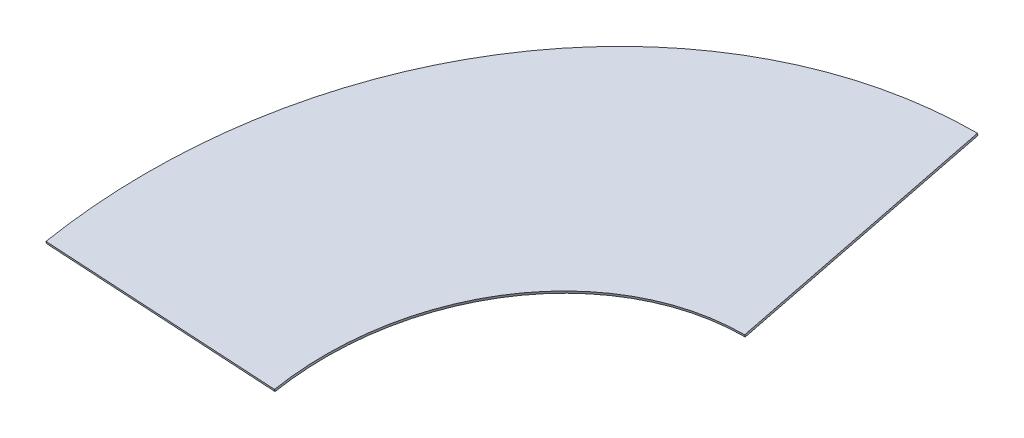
ISO-10303-21;
HEADER;
FILE_DESCRIPTION(('STEP AP214'),'2;1');
FILE_NAME('part.step','',(''),(''),'','','');
FILE_SCHEMA(('AUTOMOTIVE_DESIGN { 1 0 10303 214 1 1 1 1 }'));
ENDSEC;
DATA;
#1=APPLICATION_CONTEXT('core data for automotive mechanical design processes');
#2=APPLICATION_PROTOCOL_DEFINITION('international standard','automotive_design',2000,#1);
#3=PRODUCT_CONTEXT('',#1,'mechanical');
#4=PRODUCT('Part','Part','',(#3));
#5=PRODUCT_RELATED_PRODUCT_CATEGORY('part','',(#4));
#6=PRODUCT_DEFINITION_FORMATION('','',#4);
#7=PRODUCT_DEFINITION_CONTEXT('part definition',#1,'design');
#8=PRODUCT_DEFINITION('design','',#6,#7);
#9=PRODUCT_DEFINITION_SHAPE('','',#8);
#10=(LENGTH_UNIT() NAMED_UNIT(*) SI_UNIT(.MILLI.,.METRE.));
#11=(NAMED_UNIT(*) PLANE_ANGLE_UNIT() SI_UNIT($,.RADIAN.));
#12=(NAMED_UNIT(*) SI_UNIT($,.STERADIAN.) SOLID_ANGLE_UNIT());
#13=UNCERTAINTY_MEASURE_WITH_UNIT(LENGTH_MEASURE(1.E-05),#10,'distance_accuracy_value','');
#14=(GEOMETRIC_REPRESENTATION_CONTEXT(3) GLOBAL_UNCERTAINTY_ASSIGNED_CONTEXT((#13)) GLOBAL_UNIT_ASSIGNED_CONTEXT((#10,
#11,#12)) REPRESENTATION_CONTEXT('',''));
#15=CARTESIAN_POINT('',(0.,0.,0.));
#16=DIRECTION('',(0.,0.,1.));
#17=DIRECTION('',(1.,0.,0.));
#18=AXIS2_PLACEMENT_3D('',#15,#16,#17);
#19=CARTESIAN_POINT('',(0.,50.,0.));
#20=DIRECTION('',(1.,0.,0.));
#21=DIRECTION('',(0.,-0.242535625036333,0.970142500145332));
#22=AXIS2_PLACEMENT_3D('',#19,#20,#21);
#23=PLANE('',#22);
#24=DIRECTION('',(0.,-0.970142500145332,-0.242535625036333));
#25=VECTOR('',#24,1.);
#26=CARTESIAN_POINT('',(0.,50.,0.));
#27=LINE('',#26,#25);
#28=CARTESIAN_POINT('',(0.,50.9701425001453,0.242535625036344));
#29=VERTEX_POINT('',#28);
#30=CARTESIAN_POINT('',(0.,50.,0.));
#31=VERTEX_POINT('',#30);
#32=EDGE_CURVE('E12',#29,#31,#27,.T.);
#33=ORIENTED_EDGE('',*,*,#32,.F.);
#34=DIRECTION('',(0.,0.242535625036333,-0.970142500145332));
#35=VECTOR('',#34,1.);
#36=CARTESIAN_POINT('',(0.,0.970142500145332,200.242535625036));
#37=LINE('',#36,#35);
#38=CARTESIAN_POINT('',(0.,25.9701425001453,100.242535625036));
#39=VERTEX_POINT('',#38);
#40=EDGE_CURVE('E88',#29,#39,#37,.F.);
#41=ORIENTED_EDGE('',*,*,#40,.T.);
#42=DIRECTION('',(0.,-0.970142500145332,-0.242535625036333));
#43=VECTOR('',#42,1.);
#44=CARTESIAN_POINT('',(0.,25.,100.));
#45=LINE('',#44,#43);
#46=CARTESIAN_POINT('',(0.,25.,100.));
#47=VERTEX_POINT('',#46);
#48=EDGE_CURVE('E62',#39,#47,#45,.T.);
#49=ORIENTED_EDGE('',*,*,#48,.T.);
#50=DIRECTION('',(0.,-0.242535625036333,0.970142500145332));
#51=VECTOR('',#50,1.);
#52=CARTESIAN_POINT('',(0.,50.,0.));
#53=LINE('',#52,#51);
#54=EDGE_CURVE('E91',#31,#47,#53,.T.);
#55=ORIENTED_EDGE('',*,*,#54,.F.);
#56=EDGE_LOOP('',(#33,#41,#49,#55));
#57=FACE_BOUND('',#56,.T.);
#58=ADVANCED_FACE('F52',(#57),#23,.T.);
#59=CARTESIAN_POINT('',(0.,-0.485071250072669,201.940285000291));
#60=DIRECTION('',(0.,0.970142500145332,0.242535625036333));
#61=DIRECTION('',(0.,-0.242535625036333,0.970142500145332));
#62=AXIS2_PLACEMENT_3D('',#59,#60,#61);
#63=CYLINDRICAL_SURFACE('',#62,105.077640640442);
#64=ORIENTED_EDGE('',*,*,#48,.F.);
#65=CARTESIAN_POINT('',(0.,0.485071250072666,202.182820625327));
#66=DIRECTION('',(0.,0.970142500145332,0.242535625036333));
#67=DIRECTION('',(0.,-0.242535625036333,0.970142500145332));
#68=AXIS2_PLACEMENT_3D('',#65,#66,#67);
#69=CIRCLE('',#68,105.077640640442);
#70=CARTESIAN_POINT('',(-104.956824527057,1.70682379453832,197.295810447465));
#71=VERTEX_POINT('',#70);
#72=EDGE_CURVE('E103',#39,#71,#69,.T.);
#73=ORIENTED_EDGE('',*,*,#72,.T.);
#74=DIRECTION('',(0.,-0.970142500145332,-0.242535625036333));
#75=VECTOR('',#74,1.);
#76=CARTESIAN_POINT('',(-104.956824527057,0.736681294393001,197.053274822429));
#77=LINE('',#76,#75);
#78=CARTESIAN_POINT('',(-104.956824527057,0.736681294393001,197.053274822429));
#79=VERTEX_POINT('',#78);
#80=EDGE_CURVE('E112',#71,#79,#77,.T.);
#81=ORIENTED_EDGE('',*,*,#80,.T.);
#82=CARTESIAN_POINT('',(0.,-0.485071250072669,201.940285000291));
#83=DIRECTION('',(0.,0.970142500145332,0.242535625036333));
#84=DIRECTION('',(0.,0.242535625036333,-0.970142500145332));
#85=AXIS2_PLACEMENT_3D('',#82,#83,#84);
#86=CIRCLE('',#85,105.077640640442);
#87=EDGE_CURVE('E107',#47,#79,#86,.T.);
#88=ORIENTED_EDGE('',*,*,#87,.F.);
#89=EDGE_LOOP('',(#64,#73,#81,#88));
#90=FACE_BOUND('',#89,.T.);
#91=ADVANCED_FACE('F120',(#90),#63,.F.);
#92=CARTESIAN_POINT('',(-207.915948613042,1.93517955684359,192.259281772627));
#93=DIRECTION('',(-0.0479399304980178,-0.24225676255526,0.96902705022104));
#94=DIRECTION('',(-0.998850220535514,0.0116271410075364,-0.0465085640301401));
#95=AXIS2_PLACEMENT_3D('',#92,#93,#94);
#96=PLANE('',#95);
#97=ORIENTED_EDGE('',*,*,#80,.F.);
#98=DIRECTION('',(-0.998850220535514,0.0116271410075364,-0.0465085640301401));
#99=VECTOR('',#98,1.);
#100=CARTESIAN_POINT('',(-207.915948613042,2.90532205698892,192.501817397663));
#101=LINE('',#100,#99);
#102=CARTESIAN_POINT('',(-207.915948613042,2.90532205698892,192.501817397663));
#103=VERTEX_POINT('',#102);
#104=EDGE_CURVE('E105',#71,#103,#101,.T.);
#105=ORIENTED_EDGE('',*,*,#104,.T.);
#106=DIRECTION('',(0.,-0.970142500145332,-0.242535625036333));
#107=VECTOR('',#106,1.);
#108=CARTESIAN_POINT('',(-207.915948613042,1.93517955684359,192.259281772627));
#109=LINE('',#108,#107);
#110=CARTESIAN_POINT('',(-207.915948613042,1.93517955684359,192.259281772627));
#111=VERTEX_POINT('',#110);
#112=EDGE_CURVE('E56',#103,#111,#109,.T.);
#113=ORIENTED_EDGE('',*,*,#112,.T.);
#114=DIRECTION('',(-0.998850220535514,0.0116271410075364,-0.0465085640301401));
#115=VECTOR('',#114,1.);
#116=CARTESIAN_POINT('',(-207.915948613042,1.93517955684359,192.259281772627));
#117=LINE('',#116,#115);
#118=EDGE_CURVE('E121',#79,#111,#117,.T.);
#119=ORIENTED_EDGE('',*,*,#118,.F.);
#120=EDGE_LOOP('',(#97,#105,#113,#119));
#121=FACE_BOUND('',#120,.T.);
#122=ADVANCED_FACE('F125',(#121),#96,.T.);
#123=CARTESIAN_POINT('',(0.,-0.485071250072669,201.940285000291));
#124=DIRECTION('',(0.,-0.970142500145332,-0.242535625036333));
#125=DIRECTION('',(0.,0.242535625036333,-0.970142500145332));
#126=AXIS2_PLACEMENT_3D('',#123,#124,#125);
#127=CYLINDRICAL_SURFACE('',#126,208.155281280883);
#128=CARTESIAN_POINT('',(0.,0.485071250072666,202.182820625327));
#129=DIRECTION('',(0.,-0.970142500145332,-0.242535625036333));
#130=DIRECTION('',(0.,0.242535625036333,-0.970142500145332));
#131=AXIS2_PLACEMENT_3D('',#128,#129,#130);
#132=CIRCLE('',#131,208.155281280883);
#133=EDGE_CURVE('E101',#103,#29,#132,.T.);
#134=ORIENTED_EDGE('',*,*,#133,.T.);
#135=ORIENTED_EDGE('',*,*,#32,.T.);
#136=CARTESIAN_POINT('',(0.,-0.485071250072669,201.940285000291));
#137=DIRECTION('',(0.,-0.970142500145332,-0.242535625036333));
#138=DIRECTION('',(0.,0.242535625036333,-0.970142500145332));
#139=AXIS2_PLACEMENT_3D('',#136,#137,#138);
#140=CIRCLE('',#139,208.155281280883);
#141=EDGE_CURVE('E119',#111,#31,#140,.T.);
#142=ORIENTED_EDGE('',*,*,#141,.F.);
#143=ORIENTED_EDGE('',*,*,#112,.F.);
#144=EDGE_LOOP('',(#134,#135,#142,#143));
#145=FACE_BOUND('',#144,.T.);
#146=ADVANCED_FACE('F54',(#145),#127,.T.);
#147=CARTESIAN_POINT('',(0.,0.,200.));
#148=DIRECTION('',(0.,-0.970142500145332,-0.242535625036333));
#149=DIRECTION('',(0.,0.242535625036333,-0.970142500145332));
#150=AXIS2_PLACEMENT_3D('',#147,#148,#149);
#151=PLANE('',#150);
#152=ORIENTED_EDGE('',*,*,#118,.T.);
#153=ORIENTED_EDGE('',*,*,#141,.T.);
#154=ORIENTED_EDGE('',*,*,#54,.T.);
#155=ORIENTED_EDGE('',*,*,#87,.T.);
#156=EDGE_LOOP('',(#152,#153,#154,#155));
#157=FACE_BOUND('',#156,.T.);
#158=ADVANCED_FACE('F118',(#157),#151,.T.);
#159=CARTESIAN_POINT('',(0.,0.970142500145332,200.242535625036));
#160=DIRECTION('',(0.,-0.970142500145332,-0.242535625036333));
#161=DIRECTION('',(0.,0.242535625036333,-0.970142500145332));
#162=AXIS2_PLACEMENT_3D('',#159,#160,#161);
#163=PLANE('',#162);
#164=ORIENTED_EDGE('',*,*,#104,.F.);
#165=ORIENTED_EDGE('',*,*,#72,.F.);
#166=ORIENTED_EDGE('',*,*,#40,.F.);
#167=ORIENTED_EDGE('',*,*,#133,.F.);
#168=EDGE_LOOP('',(#164,#165,#166,#167));
#169=FACE_BOUND('',#168,.T.);
#170=ADVANCED_FACE('F100',(#169),#163,.F.);
#171=CLOSED_SHELL('',(#58,#91,#122,#146,#158,#170));
#172=MANIFOLD_SOLID_BREP('B2',#171);
#173=ADVANCED_BREP_SHAPE_REPRESENTATION('',(#18,#172),#14);
#174=SHAPE_DEFINITION_REPRESENTATION(#9,#173);
ENDSEC;
END-ISO-10303-21;
